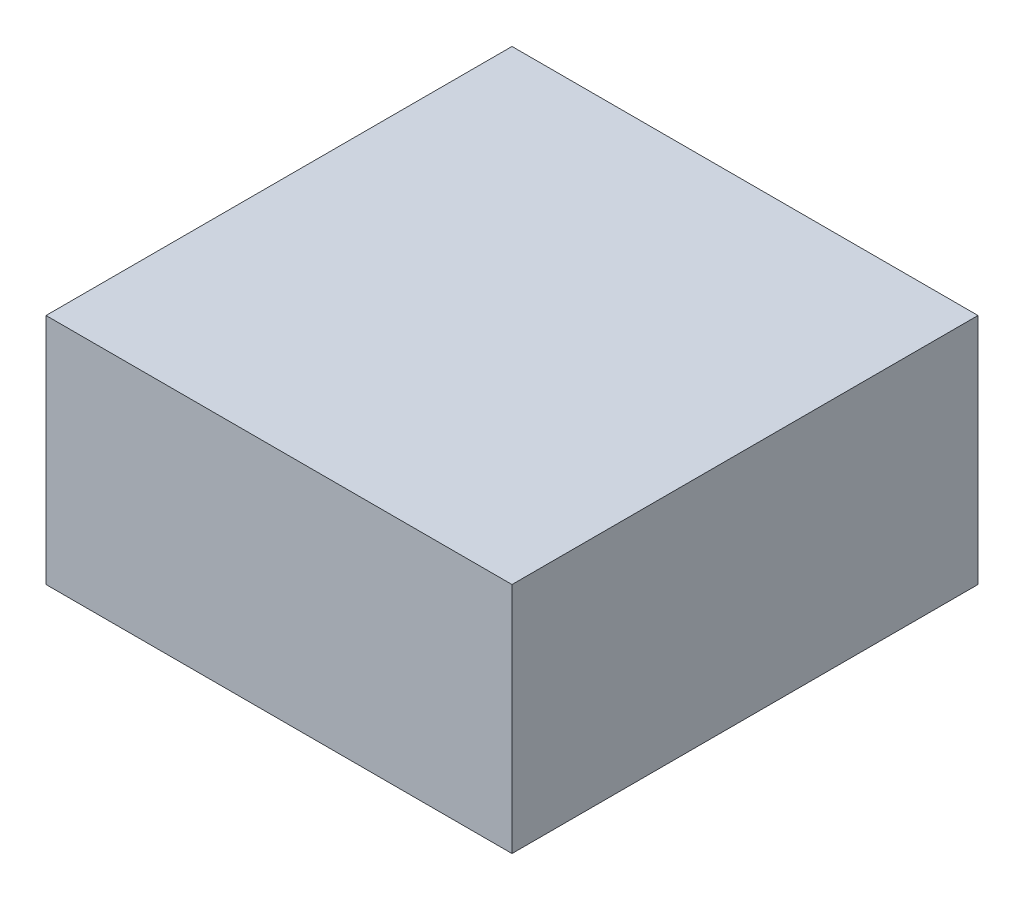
from build123d import *

# Parameters (mm, degrees)
SKIZZE1_W                       = 100
SKIZZE1_H                       = 100
AUFSATZ_LINEAR_AUSTRAGEN1_DEPTH = 50


with BuildPart() as part:
    # Skizze1 → Aufsatz-Linear austragen1 (new body)
    with BuildSketch(Plane(origin=(0, 0, 0), x_dir=(1, 0, 0), z_dir=(0, 1, 0))):
        with Locations((-50, 50)):
            Rectangle(SKIZZE1_W, SKIZZE1_H)
    extrude(amount=AUFSATZ_LINEAR_AUSTRAGEN1_DEPTH)


solid = part.part
